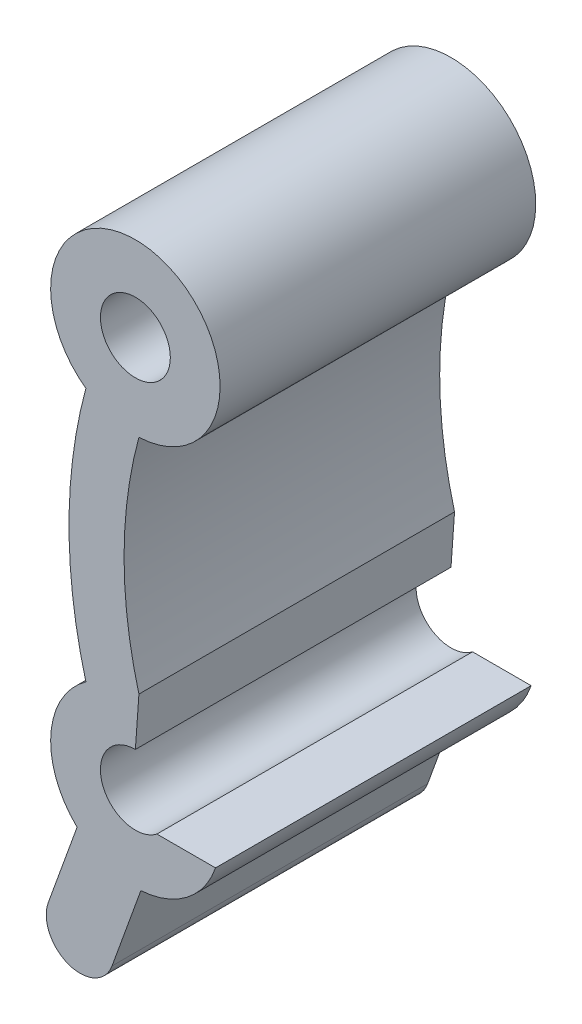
ISO-10303-21;
HEADER;
FILE_DESCRIPTION(('STEP AP214'),'2;1');
FILE_NAME('part.step','',(''),(''),'','','');
FILE_SCHEMA(('AUTOMOTIVE_DESIGN { 1 0 10303 214 1 1 1 1 }'));
ENDSEC;
DATA;
#1=APPLICATION_CONTEXT('core data for automotive mechanical design processes');
#2=APPLICATION_PROTOCOL_DEFINITION('international standard','automotive_design',2000,#1);
#3=PRODUCT_CONTEXT('',#1,'mechanical');
#4=PRODUCT('Part','Part','',(#3));
#5=PRODUCT_RELATED_PRODUCT_CATEGORY('part','',(#4));
#6=PRODUCT_DEFINITION_FORMATION('','',#4);
#7=PRODUCT_DEFINITION_CONTEXT('part definition',#1,'design');
#8=PRODUCT_DEFINITION('design','',#6,#7);
#9=PRODUCT_DEFINITION_SHAPE('','',#8);
#10=(LENGTH_UNIT() NAMED_UNIT(*) SI_UNIT(.MILLI.,.METRE.));
#11=(NAMED_UNIT(*) PLANE_ANGLE_UNIT() SI_UNIT($,.RADIAN.));
#12=(NAMED_UNIT(*) SI_UNIT($,.STERADIAN.) SOLID_ANGLE_UNIT());
#13=UNCERTAINTY_MEASURE_WITH_UNIT(LENGTH_MEASURE(1.E-05),#10,'distance_accuracy_value','');
#14=(GEOMETRIC_REPRESENTATION_CONTEXT(3) GLOBAL_UNCERTAINTY_ASSIGNED_CONTEXT((#13)) GLOBAL_UNIT_ASSIGNED_CONTEXT((#10,
#11,#12)) REPRESENTATION_CONTEXT('',''));
#15=CARTESIAN_POINT('',(0.,0.,0.));
#16=DIRECTION('',(0.,0.,1.));
#17=DIRECTION('',(1.,0.,0.));
#18=AXIS2_PLACEMENT_3D('',#15,#16,#17);
#19=CARTESIAN_POINT('',(152.544315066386,40.7534812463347,7.45));
#20=DIRECTION('',(0.,0.,1.));
#21=DIRECTION('',(1.,0.,0.));
#22=AXIS2_PLACEMENT_3D('',#19,#20,#21);
#23=PLANE('',#22);
#24=CARTESIAN_POINT('',(152.544315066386,40.7534812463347,7.45));
#25=DIRECTION('',(0.,0.,1.));
#26=DIRECTION('',(1.,0.,0.));
#27=AXIS2_PLACEMENT_3D('',#24,#25,#26);
#28=CIRCLE('',#27,4.00000400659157);
#29=CARTESIAN_POINT('',(152.802058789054,36.761789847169,7.45));
#30=VERTEX_POINT('',#29);
#31=CARTESIAN_POINT('',(156.32717430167,39.4534781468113,7.45));
#32=VERTEX_POINT('',#31);
#33=EDGE_CURVE('E169',#30,#32,#28,.T.);
#34=ORIENTED_EDGE('',*,*,#33,.T.);
#35=DIRECTION('',(-1.,0.,0.));
#36=VECTOR('',#35,1.);
#37=CARTESIAN_POINT('',(156.32717430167,39.4534781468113,7.45));
#38=LINE('',#37,#36);
#39=CARTESIAN_POINT('',(153.560443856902,39.4534781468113,7.45));
#40=VERTEX_POINT('',#39);
#41=EDGE_CURVE('E102',#32,#40,#38,.T.);
#42=ORIENTED_EDGE('',*,*,#41,.T.);
#43=CARTESIAN_POINT('',(152.544315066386,40.7534812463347,7.45));
#44=DIRECTION('',(0.,0.,-1.));
#45=DIRECTION('',(1.,0.,0.));
#46=AXIS2_PLACEMENT_3D('',#43,#44,#45);
#47=CIRCLE('',#46,1.65000781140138);
#48=CARTESIAN_POINT('',(152.544315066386,42.4034890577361,7.45));
#49=VERTEX_POINT('',#48);
#50=EDGE_CURVE('E193',#40,#49,#47,.T.);
#51=ORIENTED_EDGE('',*,*,#50,.T.);
#52=DIRECTION('',(0.0709048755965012,0.997483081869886,0.));
#53=VECTOR('',#52,1.);
#54=CARTESIAN_POINT('',(152.711114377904,44.7500059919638,7.45));
#55=LINE('',#54,#53);
#56=CARTESIAN_POINT('',(152.711114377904,44.7500059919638,7.45));
#57=VERTEX_POINT('',#56);
#58=EDGE_CURVE('E212',#49,#57,#55,.T.);
#59=ORIENTED_EDGE('',*,*,#58,.T.);
#60=CARTESIAN_POINT('',(172.009754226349,50.0000059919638,7.45));
#61=DIRECTION('',(0.,0.,-1.));
#62=DIRECTION('',(1.,0.,0.));
#63=AXIS2_PLACEMENT_3D('',#60,#61,#62);
#64=CIRCLE('',#63,20.);
#65=CARTESIAN_POINT('',(152.711114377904,55.2500059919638,7.45));
#66=VERTEX_POINT('',#65);
#67=EDGE_CURVE('E209',#57,#66,#64,.T.);
#68=ORIENTED_EDGE('',*,*,#67,.T.);
#69=CARTESIAN_POINT('',(152.544315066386,59.246530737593,7.45));
#70=DIRECTION('',(0.,0.,1.));
#71=DIRECTION('',(1.,0.,0.));
#72=AXIS2_PLACEMENT_3D('',#69,#70,#71);
#73=CIRCLE('',#72,4.00000400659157);
#74=CARTESIAN_POINT('',(150.207627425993,56.0000059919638,7.45));
#75=VERTEX_POINT('',#74);
#76=EDGE_CURVE('E211',#66,#75,#73,.T.);
#77=ORIENTED_EDGE('',*,*,#76,.T.);
#78=CARTESIAN_POINT('',(172.411230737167,50.0000059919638,7.45));
#79=DIRECTION('',(0.,0.,1.));
#80=DIRECTION('',(1.,0.,0.));
#81=AXIS2_PLACEMENT_3D('',#78,#79,#80);
#82=CIRCLE('',#81,23.);
#83=CARTESIAN_POINT('',(150.207627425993,44.0000059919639,7.45));
#84=VERTEX_POINT('',#83);
#85=EDGE_CURVE('E214',#75,#84,#82,.T.);
#86=ORIENTED_EDGE('',*,*,#85,.T.);
#87=CARTESIAN_POINT('',(152.544315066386,40.7534812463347,7.45));
#88=DIRECTION('',(0.,0.,1.));
#89=DIRECTION('',(1.,0.,0.));
#90=AXIS2_PLACEMENT_3D('',#87,#88,#89);
#91=CIRCLE('',#90,4.00000400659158);
#92=CARTESIAN_POINT('',(149.792826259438,37.8501484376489,7.45));
#93=VERTEX_POINT('',#92);
#94=EDGE_CURVE('E130',#84,#93,#91,.T.);
#95=ORIENTED_EDGE('',*,*,#94,.T.);
#96=DIRECTION('',(-0.340110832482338,-0.940385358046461,0.));
#97=VECTOR('',#96,1.);
#98=CARTESIAN_POINT('',(149.792826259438,37.8501484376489,7.45));
#99=LINE('',#98,#97);
#100=CARTESIAN_POINT('',(148.432382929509,34.088607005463,7.45));
#101=VERTEX_POINT('',#100);
#102=EDGE_CURVE('E124',#93,#101,#99,.T.);
#103=ORIENTED_EDGE('',*,*,#102,.T.);
#104=CARTESIAN_POINT('',(149.936998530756,33.5444258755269,7.45));
#105=DIRECTION('',(0.,0.,1.));
#106=DIRECTION('',(1.,0.,0.));
#107=AXIS2_PLACEMENT_3D('',#104,#105,#106);
#108=CIRCLE('',#107,1.60000037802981);
#109=CARTESIAN_POINT('',(151.441615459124,33.0002484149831,7.45));
#110=VERTEX_POINT('',#109);
#111=EDGE_CURVE('E128',#101,#110,#108,.T.);
#112=ORIENTED_EDGE('',*,*,#111,.T.);
#113=DIRECTION('',(0.340110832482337,0.940385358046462,0.));
#114=VECTOR('',#113,1.);
#115=CARTESIAN_POINT('',(151.441615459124,33.0002484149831,7.45));
#116=LINE('',#115,#114);
#117=EDGE_CURVE('E50',#110,#30,#116,.T.);
#118=ORIENTED_EDGE('',*,*,#117,.T.);
#119=EDGE_LOOP('',(#34,#42,#51,#59,#68,#77,#86,#95,#103,#112,#118));
#120=FACE_BOUND('',#119,.T.);
#121=CARTESIAN_POINT('',(152.544315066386,59.246530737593,7.45));
#122=DIRECTION('',(0.,0.,1.));
#123=DIRECTION('',(1.,0.,0.));
#124=AXIS2_PLACEMENT_3D('',#121,#122,#123);
#125=CIRCLE('',#124,1.65000781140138);
#126=CARTESIAN_POINT('',(154.194322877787,59.246530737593,7.45));
#127=VERTEX_POINT('',#126);
#128=EDGE_CURVE('E152',#127,#127,#125,.T.);
#129=ORIENTED_EDGE('',*,*,#128,.F.);
#130=EDGE_LOOP('',(#129));
#131=FACE_BOUND('',#130,.T.);
#132=ADVANCED_FACE('F33',(#120,#131),#23,.T.);
#133=CARTESIAN_POINT('',(152.544315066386,40.7534812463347,-7.45));
#134=DIRECTION('',(0.,0.,1.));
#135=DIRECTION('',(1.,0.,0.));
#136=AXIS2_PLACEMENT_3D('',#133,#134,#135);
#137=PLANE('',#136);
#138=CARTESIAN_POINT('',(152.544315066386,40.7534812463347,-7.45));
#139=DIRECTION('',(0.,0.,1.));
#140=DIRECTION('',(1.,0.,0.));
#141=AXIS2_PLACEMENT_3D('',#138,#139,#140);
#142=CIRCLE('',#141,4.00000400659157);
#143=CARTESIAN_POINT('',(152.802058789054,36.761789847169,-7.45));
#144=VERTEX_POINT('',#143);
#145=CARTESIAN_POINT('',(156.32717430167,39.4534781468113,-7.45));
#146=VERTEX_POINT('',#145);
#147=EDGE_CURVE('E148',#144,#146,#142,.T.);
#148=ORIENTED_EDGE('',*,*,#147,.F.);
#149=DIRECTION('',(0.340110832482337,0.940385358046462,0.));
#150=VECTOR('',#149,1.);
#151=CARTESIAN_POINT('',(151.441615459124,33.0002484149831,-7.45));
#152=LINE('',#151,#150);
#153=CARTESIAN_POINT('',(151.441615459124,33.0002484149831,-7.45));
#154=VERTEX_POINT('',#153);
#155=EDGE_CURVE('E94',#154,#144,#152,.T.);
#156=ORIENTED_EDGE('',*,*,#155,.F.);
#157=CARTESIAN_POINT('',(149.936998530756,33.5444258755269,-7.45));
#158=DIRECTION('',(0.,0.,1.));
#159=DIRECTION('',(1.,0.,0.));
#160=AXIS2_PLACEMENT_3D('',#157,#158,#159);
#161=CIRCLE('',#160,1.60000037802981);
#162=CARTESIAN_POINT('',(148.432382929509,34.088607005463,-7.45));
#163=VERTEX_POINT('',#162);
#164=EDGE_CURVE('E88',#163,#154,#161,.T.);
#165=ORIENTED_EDGE('',*,*,#164,.F.);
#166=DIRECTION('',(-0.340110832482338,-0.940385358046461,0.));
#167=VECTOR('',#166,1.);
#168=CARTESIAN_POINT('',(149.792826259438,37.8501484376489,-7.45));
#169=LINE('',#168,#167);
#170=CARTESIAN_POINT('',(149.792826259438,37.8501484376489,-7.45));
#171=VERTEX_POINT('',#170);
#172=EDGE_CURVE('E138',#171,#163,#169,.T.);
#173=ORIENTED_EDGE('',*,*,#172,.F.);
#174=CARTESIAN_POINT('',(152.544315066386,40.7534812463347,-7.45));
#175=DIRECTION('',(0.,0.,1.));
#176=DIRECTION('',(1.,0.,0.));
#177=AXIS2_PLACEMENT_3D('',#174,#175,#176);
#178=CIRCLE('',#177,4.00000400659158);
#179=CARTESIAN_POINT('',(150.207627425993,44.0000059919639,-7.45));
#180=VERTEX_POINT('',#179);
#181=EDGE_CURVE('E164',#180,#171,#178,.T.);
#182=ORIENTED_EDGE('',*,*,#181,.F.);
#183=CARTESIAN_POINT('',(172.411230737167,50.0000059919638,-7.45));
#184=DIRECTION('',(0.,0.,1.));
#185=DIRECTION('',(1.,0.,0.));
#186=AXIS2_PLACEMENT_3D('',#183,#184,#185);
#187=CIRCLE('',#186,23.);
#188=CARTESIAN_POINT('',(150.207627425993,56.0000059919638,-7.45));
#189=VERTEX_POINT('',#188);
#190=EDGE_CURVE('E162',#189,#180,#187,.T.);
#191=ORIENTED_EDGE('',*,*,#190,.F.);
#192=CARTESIAN_POINT('',(152.544315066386,59.246530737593,-7.45));
#193=DIRECTION('',(0.,0.,1.));
#194=DIRECTION('',(1.,0.,0.));
#195=AXIS2_PLACEMENT_3D('',#192,#193,#194);
#196=CIRCLE('',#195,4.00000400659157);
#197=CARTESIAN_POINT('',(152.711114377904,55.2500059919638,-7.45));
#198=VERTEX_POINT('',#197);
#199=EDGE_CURVE('E160',#198,#189,#196,.T.);
#200=ORIENTED_EDGE('',*,*,#199,.F.);
#201=CARTESIAN_POINT('',(172.009754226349,50.0000059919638,-7.45));
#202=DIRECTION('',(0.,0.,-1.));
#203=DIRECTION('',(1.,0.,0.));
#204=AXIS2_PLACEMENT_3D('',#201,#202,#203);
#205=CIRCLE('',#204,20.);
#206=CARTESIAN_POINT('',(152.711114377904,44.7500059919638,-7.45));
#207=VERTEX_POINT('',#206);
#208=EDGE_CURVE('E158',#207,#198,#205,.T.);
#209=ORIENTED_EDGE('',*,*,#208,.F.);
#210=DIRECTION('',(0.0709048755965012,0.997483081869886,0.));
#211=VECTOR('',#210,1.);
#212=CARTESIAN_POINT('',(152.711114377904,44.7500059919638,-7.45));
#213=LINE('',#212,#211);
#214=CARTESIAN_POINT('',(152.544315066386,42.4034890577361,-7.45));
#215=VERTEX_POINT('',#214);
#216=EDGE_CURVE('E156',#215,#207,#213,.T.);
#217=ORIENTED_EDGE('',*,*,#216,.F.);
#218=CARTESIAN_POINT('',(152.544315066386,40.7534812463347,-7.45));
#219=DIRECTION('',(0.,0.,-1.));
#220=DIRECTION('',(1.,0.,0.));
#221=AXIS2_PLACEMENT_3D('',#218,#219,#220);
#222=CIRCLE('',#221,1.65000781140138);
#223=CARTESIAN_POINT('',(153.560443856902,39.4534781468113,-7.45));
#224=VERTEX_POINT('',#223);
#225=EDGE_CURVE('E154',#224,#215,#222,.T.);
#226=ORIENTED_EDGE('',*,*,#225,.F.);
#227=DIRECTION('',(-1.,0.,0.));
#228=VECTOR('',#227,1.);
#229=CARTESIAN_POINT('',(156.32717430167,39.4534781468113,-7.45));
#230=LINE('',#229,#228);
#231=EDGE_CURVE('E151',#146,#224,#230,.T.);
#232=ORIENTED_EDGE('',*,*,#231,.F.);
#233=EDGE_LOOP('',(#148,#156,#165,#173,#182,#191,#200,#209,#217,#226,#232));
#234=FACE_BOUND('',#233,.T.);
#235=CARTESIAN_POINT('',(152.544315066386,59.246530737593,-7.45));
#236=DIRECTION('',(0.,0.,1.));
#237=DIRECTION('',(1.,0.,0.));
#238=AXIS2_PLACEMENT_3D('',#235,#236,#237);
#239=CIRCLE('',#238,1.65000781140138);
#240=CARTESIAN_POINT('',(154.194322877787,59.246530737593,-7.45));
#241=VERTEX_POINT('',#240);
#242=EDGE_CURVE('E352',#241,#241,#239,.T.);
#243=ORIENTED_EDGE('',*,*,#242,.T.);
#244=EDGE_LOOP('',(#243));
#245=FACE_BOUND('',#244,.T.);
#246=ADVANCED_FACE('F197',(#234,#245),#137,.F.);
#247=CARTESIAN_POINT('',(152.544315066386,40.7534812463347,7.45));
#248=DIRECTION('',(0.,0.,-1.));
#249=DIRECTION('',(-1.,0.,0.));
#250=AXIS2_PLACEMENT_3D('',#247,#248,#249);
#251=CYLINDRICAL_SURFACE('',#250,4.00000400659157);
#252=ORIENTED_EDGE('',*,*,#147,.T.);
#253=DIRECTION('',(0.,0.,-1.));
#254=VECTOR('',#253,1.);
#255=CARTESIAN_POINT('',(156.32717430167,39.4534781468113,7.45));
#256=LINE('',#255,#254);
#257=EDGE_CURVE('E11',#32,#146,#256,.T.);
#258=ORIENTED_EDGE('',*,*,#257,.F.);
#259=ORIENTED_EDGE('',*,*,#33,.F.);
#260=DIRECTION('',(0.,0.,-1.));
#261=VECTOR('',#260,1.);
#262=CARTESIAN_POINT('',(152.802058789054,36.761789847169,7.45));
#263=LINE('',#262,#261);
#264=EDGE_CURVE('E144',#30,#144,#263,.T.);
#265=ORIENTED_EDGE('',*,*,#264,.T.);
#266=EDGE_LOOP('',(#252,#258,#259,#265));
#267=FACE_BOUND('',#266,.T.);
#268=ADVANCED_FACE('F35',(#267),#251,.T.);
#269=CARTESIAN_POINT('',(156.32717430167,39.4534781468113,7.45));
#270=DIRECTION('',(0.,-1.,0.));
#271=DIRECTION('',(0.,0.,-1.));
#272=AXIS2_PLACEMENT_3D('',#269,#270,#271);
#273=PLANE('',#272);
#274=ORIENTED_EDGE('',*,*,#231,.T.);
#275=DIRECTION('',(0.,0.,-1.));
#276=VECTOR('',#275,1.);
#277=CARTESIAN_POINT('',(153.560443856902,39.4534781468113,7.45));
#278=LINE('',#277,#276);
#279=EDGE_CURVE('E42',#40,#224,#278,.T.);
#280=ORIENTED_EDGE('',*,*,#279,.F.);
#281=ORIENTED_EDGE('',*,*,#41,.F.);
#282=ORIENTED_EDGE('',*,*,#257,.T.);
#283=EDGE_LOOP('',(#274,#280,#281,#282));
#284=FACE_BOUND('',#283,.T.);
#285=ADVANCED_FACE('F251',(#284),#273,.F.);
#286=CARTESIAN_POINT('',(152.544315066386,40.7534812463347,7.45));
#287=DIRECTION('',(0.,0.,-1.));
#288=DIRECTION('',(-1.,0.,0.));
#289=AXIS2_PLACEMENT_3D('',#286,#287,#288);
#290=CYLINDRICAL_SURFACE('',#289,1.65000781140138);
#291=ORIENTED_EDGE('',*,*,#225,.T.);
#292=DIRECTION('',(0.,0.,-1.));
#293=VECTOR('',#292,1.);
#294=CARTESIAN_POINT('',(152.544315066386,42.4034890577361,7.45));
#295=LINE('',#294,#293);
#296=EDGE_CURVE('E185',#49,#215,#295,.T.);
#297=ORIENTED_EDGE('',*,*,#296,.F.);
#298=ORIENTED_EDGE('',*,*,#50,.F.);
#299=ORIENTED_EDGE('',*,*,#279,.T.);
#300=EDGE_LOOP('',(#291,#297,#298,#299));
#301=FACE_BOUND('',#300,.T.);
#302=ADVANCED_FACE('F191',(#301),#290,.F.);
#303=CARTESIAN_POINT('',(152.711114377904,44.7500059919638,7.45));
#304=DIRECTION('',(-0.997483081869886,0.0709048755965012,0.));
#305=DIRECTION('',(-0.0709048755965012,-0.997483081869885,0.));
#306=AXIS2_PLACEMENT_3D('',#303,#304,#305);
#307=PLANE('',#306);
#308=ORIENTED_EDGE('',*,*,#216,.T.);
#309=DIRECTION('',(0.,0.,-1.));
#310=VECTOR('',#309,1.);
#311=CARTESIAN_POINT('',(152.711114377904,44.7500059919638,7.45));
#312=LINE('',#311,#310);
#313=EDGE_CURVE('E182',#57,#207,#312,.T.);
#314=ORIENTED_EDGE('',*,*,#313,.F.);
#315=ORIENTED_EDGE('',*,*,#58,.F.);
#316=ORIENTED_EDGE('',*,*,#296,.T.);
#317=EDGE_LOOP('',(#308,#314,#315,#316));
#318=FACE_BOUND('',#317,.T.);
#319=ADVANCED_FACE('F203',(#318),#307,.F.);
#320=CARTESIAN_POINT('',(172.009754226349,50.0000059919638,7.45));
#321=DIRECTION('',(0.,0.,-1.));
#322=DIRECTION('',(-1.,0.,0.));
#323=AXIS2_PLACEMENT_3D('',#320,#321,#322);
#324=CYLINDRICAL_SURFACE('',#323,20.);
#325=ORIENTED_EDGE('',*,*,#208,.T.);
#326=DIRECTION('',(0.,0.,-1.));
#327=VECTOR('',#326,1.);
#328=CARTESIAN_POINT('',(152.711114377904,55.2500059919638,7.45));
#329=LINE('',#328,#327);
#330=EDGE_CURVE('E179',#66,#198,#329,.T.);
#331=ORIENTED_EDGE('',*,*,#330,.F.);
#332=ORIENTED_EDGE('',*,*,#67,.F.);
#333=ORIENTED_EDGE('',*,*,#313,.T.);
#334=EDGE_LOOP('',(#325,#331,#332,#333));
#335=FACE_BOUND('',#334,.T.);
#336=ADVANCED_FACE('F207',(#335),#324,.F.);
#337=CARTESIAN_POINT('',(152.544315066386,59.246530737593,7.45));
#338=DIRECTION('',(0.,0.,-1.));
#339=DIRECTION('',(-1.,0.,0.));
#340=AXIS2_PLACEMENT_3D('',#337,#338,#339);
#341=CYLINDRICAL_SURFACE('',#340,4.00000400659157);
#342=ORIENTED_EDGE('',*,*,#199,.T.);
#343=DIRECTION('',(0.,0.,-1.));
#344=VECTOR('',#343,1.);
#345=CARTESIAN_POINT('',(150.207627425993,56.0000059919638,7.45));
#346=LINE('',#345,#344);
#347=EDGE_CURVE('E176',#75,#189,#346,.T.);
#348=ORIENTED_EDGE('',*,*,#347,.F.);
#349=ORIENTED_EDGE('',*,*,#76,.F.);
#350=ORIENTED_EDGE('',*,*,#330,.T.);
#351=EDGE_LOOP('',(#342,#348,#349,#350));
#352=FACE_BOUND('',#351,.T.);
#353=ADVANCED_FACE('F264',(#352),#341,.T.);
#354=CARTESIAN_POINT('',(172.411230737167,50.0000059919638,7.45));
#355=DIRECTION('',(0.,0.,-1.));
#356=DIRECTION('',(-1.,0.,0.));
#357=AXIS2_PLACEMENT_3D('',#354,#355,#356);
#358=CYLINDRICAL_SURFACE('',#357,23.);
#359=ORIENTED_EDGE('',*,*,#190,.T.);
#360=DIRECTION('',(0.,0.,-1.));
#361=VECTOR('',#360,1.);
#362=CARTESIAN_POINT('',(150.207627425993,44.0000059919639,7.45));
#363=LINE('',#362,#361);
#364=EDGE_CURVE('E173',#84,#180,#363,.T.);
#365=ORIENTED_EDGE('',*,*,#364,.F.);
#366=ORIENTED_EDGE('',*,*,#85,.F.);
#367=ORIENTED_EDGE('',*,*,#347,.T.);
#368=EDGE_LOOP('',(#359,#365,#366,#367));
#369=FACE_BOUND('',#368,.T.);
#370=ADVANCED_FACE('F223',(#369),#358,.T.);
#371=CARTESIAN_POINT('',(152.544315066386,40.7534812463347,7.45));
#372=DIRECTION('',(0.,0.,-1.));
#373=DIRECTION('',(-1.,0.,0.));
#374=AXIS2_PLACEMENT_3D('',#371,#372,#373);
#375=CYLINDRICAL_SURFACE('',#374,4.00000400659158);
#376=ORIENTED_EDGE('',*,*,#181,.T.);
#377=DIRECTION('',(0.,0.,-1.));
#378=VECTOR('',#377,1.);
#379=CARTESIAN_POINT('',(149.792826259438,37.8501484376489,7.45));
#380=LINE('',#379,#378);
#381=EDGE_CURVE('E139',#93,#171,#380,.T.);
#382=ORIENTED_EDGE('',*,*,#381,.F.);
#383=ORIENTED_EDGE('',*,*,#94,.F.);
#384=ORIENTED_EDGE('',*,*,#364,.T.);
#385=EDGE_LOOP('',(#376,#382,#383,#384));
#386=FACE_BOUND('',#385,.T.);
#387=ADVANCED_FACE('F227',(#386),#375,.T.);
#388=CARTESIAN_POINT('',(149.792826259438,37.8501484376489,7.45));
#389=DIRECTION('',(0.940385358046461,-0.340110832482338,0.));
#390=DIRECTION('',(0.340110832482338,0.940385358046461,0.));
#391=AXIS2_PLACEMENT_3D('',#388,#389,#390);
#392=PLANE('',#391);
#393=ORIENTED_EDGE('',*,*,#172,.T.);
#394=DIRECTION('',(0.,0.,-1.));
#395=VECTOR('',#394,1.);
#396=CARTESIAN_POINT('',(148.432382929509,34.088607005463,7.45));
#397=LINE('',#396,#395);
#398=EDGE_CURVE('E135',#101,#163,#397,.T.);
#399=ORIENTED_EDGE('',*,*,#398,.F.);
#400=ORIENTED_EDGE('',*,*,#102,.F.);
#401=ORIENTED_EDGE('',*,*,#381,.T.);
#402=EDGE_LOOP('',(#393,#399,#400,#401));
#403=FACE_BOUND('',#402,.T.);
#404=ADVANCED_FACE('F136',(#403),#392,.F.);
#405=CARTESIAN_POINT('',(149.936998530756,33.5444258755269,7.45));
#406=DIRECTION('',(0.,0.,-1.));
#407=DIRECTION('',(-1.,0.,0.));
#408=AXIS2_PLACEMENT_3D('',#405,#406,#407);
#409=CYLINDRICAL_SURFACE('',#408,1.60000037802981);
#410=ORIENTED_EDGE('',*,*,#164,.T.);
#411=DIRECTION('',(0.,0.,-1.));
#412=VECTOR('',#411,1.);
#413=CARTESIAN_POINT('',(151.441615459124,33.0002484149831,7.45));
#414=LINE('',#413,#412);
#415=EDGE_CURVE('E140',#110,#154,#414,.T.);
#416=ORIENTED_EDGE('',*,*,#415,.F.);
#417=ORIENTED_EDGE('',*,*,#111,.F.);
#418=ORIENTED_EDGE('',*,*,#398,.T.);
#419=EDGE_LOOP('',(#410,#416,#417,#418));
#420=FACE_BOUND('',#419,.T.);
#421=ADVANCED_FACE('F142',(#420),#409,.T.);
#422=CARTESIAN_POINT('',(151.441615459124,33.0002484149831,7.45));
#423=DIRECTION('',(-0.940385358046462,0.340110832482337,0.));
#424=DIRECTION('',(-0.340110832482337,-0.940385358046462,0.));
#425=AXIS2_PLACEMENT_3D('',#422,#423,#424);
#426=PLANE('',#425);
#427=ORIENTED_EDGE('',*,*,#155,.T.);
#428=ORIENTED_EDGE('',*,*,#264,.F.);
#429=ORIENTED_EDGE('',*,*,#117,.F.);
#430=ORIENTED_EDGE('',*,*,#415,.T.);
#431=EDGE_LOOP('',(#427,#428,#429,#430));
#432=FACE_BOUND('',#431,.T.);
#433=ADVANCED_FACE('F231',(#432),#426,.F.);
#434=CARTESIAN_POINT('',(152.544315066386,59.246530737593,7.45));
#435=DIRECTION('',(0.,0.,-1.));
#436=DIRECTION('',(-1.,0.,0.));
#437=AXIS2_PLACEMENT_3D('',#434,#435,#436);
#438=CYLINDRICAL_SURFACE('',#437,1.65000781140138);
#439=ORIENTED_EDGE('',*,*,#128,.T.);
#440=EDGE_LOOP('',(#439));
#441=FACE_BOUND('',#440,.T.);
#442=ORIENTED_EDGE('',*,*,#242,.F.);
#443=EDGE_LOOP('',(#442));
#444=FACE_BOUND('',#443,.T.);
#445=ADVANCED_FACE('F233',(#441,#444),#438,.F.);
#446=CLOSED_SHELL('',(#132,#246,#268,#285,#302,#319,#336,#353,#370,#387,#404,#421,#433,#445));
#447=MANIFOLD_SOLID_BREP('B2',#446);
#448=ADVANCED_BREP_SHAPE_REPRESENTATION('',(#18,#447),#14);
#449=SHAPE_DEFINITION_REPRESENTATION(#9,#448);
ENDSEC;
END-ISO-10303-21;
